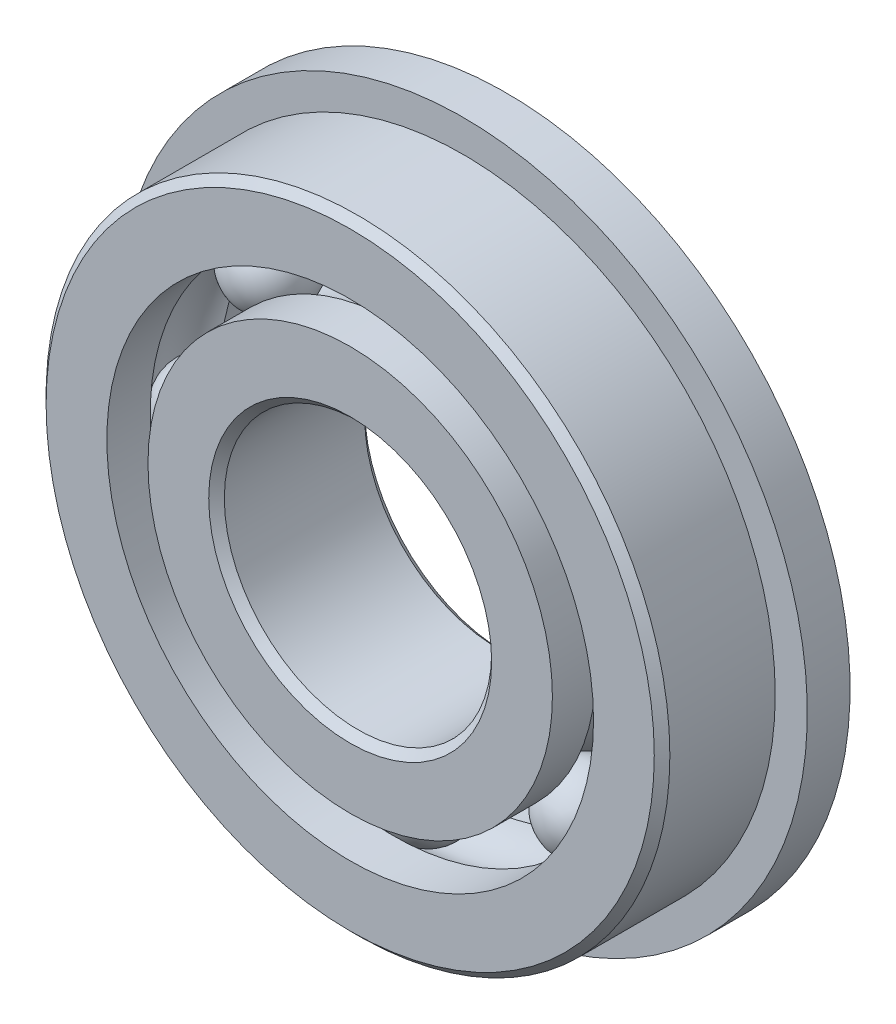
from build123d import *

# Parameters (mm, degrees)
CIRPATTERN1_COUNT = 8
SKETCH6_W         = 1.524
SKETCH6_H         = 3.585307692


with BuildPart() as part:
    # Sketch1 → Revolve1 (revolve)
    with BuildSketch(Plane(origin=(0, 0, 0), x_dir=(0, 0, -1), z_dir=(1, 0, 0)), mode=Mode.PRIVATE) as revolve1_sk:
        with BuildLine():
            Line((2.5003125, 11.1125), (-2.5003125, 11.1125))
            Line((-2.5003125, 11.1125), (-2.778125, 10.8346875))
            Line((-2.778125, 10.8346875), (-2.778125, 8.670192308))
            Line((-2.778125, 8.670192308), (-1.234722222, 8.670192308))
            ThreePointArc((-1.234722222, 8.670192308), (0, 9.373249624), (1.234722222, 8.670192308))
            Line((1.234722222, 8.670192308), (2.778125, 8.670192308))
            Line((2.778125, 8.670192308), (2.778125, 10.8346875))
            Line((2.778125, 10.8346875), (2.5003125, 11.1125))
        make_face()
    revolve(revolve1_sk.sketch.rotate(Axis((0, 0, 2.778125), (0, 0, -1)), 90), axis=Axis((0, 0, 2.778125), (0, 0, -1)))

    # Sketch6 → Revolve6 (revolve)
    with BuildSketch(Plane(origin=(0, 0, 0), x_dir=(0, 0, -1), z_dir=(1, 0, 0)), mode=Mode.PRIVATE) as revolve6_sk:
        with Locations((2.016125, 10.462846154)):
            Rectangle(SKETCH6_W, SKETCH6_H)
    revolve(revolve6_sk.sketch.rotate(Axis((0, 0, -2.778125), (0, 0, 1)), 270), axis=Axis((0, 0, -2.778125), (0, 0, 1)))


with BuildPart() as body_2:
    # Sketch3 → Revolve3 (revolve)
    with BuildSketch(Plane(origin=(0, 0, 0), x_dir=(0, 0, -1), z_dir=(1, 0, 0)), mode=Mode.PRIVATE) as revolve3_sk:
        with BuildLine():
            Line((-2.778125, 7.204807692), (-1.234722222, 7.204807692))
            ThreePointArc((-1.234722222, 7.204807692), (0, 6.501750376), (1.234722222, 7.204807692))
            Line((1.234722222, 7.204807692), (2.778125, 7.204807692))
            Line((2.778125, 7.204807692), (2.778125, 5.0403125))
            Line((2.778125, 5.0403125), (2.5003125, 4.7625))
            Line((2.5003125, 4.7625), (-2.5003125, 4.7625))
            Line((-2.5003125, 4.7625), (-2.778125, 5.0403125))
            Line((-2.778125, 5.0403125), (-2.778125, 7.204807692))
        make_face()
    revolve(revolve3_sk.sketch.rotate(Axis((0, 0, 2.778125), (0, 0, -1)), 90), axis=Axis((0, 0, 2.778125), (0, 0, -1)))


with BuildPart() as body_3:
    # Sketch4 → Revolve4 (revolve)
    with BuildSketch(Plane(origin=(0, 0, 0), x_dir=(0, 0, -1), z_dir=(1, 0, 0))):
        with BuildLine():
            Line((-1.435749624, 7.9375), (1.435749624, 7.9375))
            ThreePointArc((1.435749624, 7.9375), (0, 9.373249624), (-1.435749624, 7.9375))
        make_face()
    revolve(axis=Axis((0, 7.9375, 1.435749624), (0, 0, -1)))


with BuildPart() as cirpattern1_1:
    # CirPattern1: pattern copy
    add(body_3.part.rotate(Axis((0, 0, 0), (0, 0, 1)), 1 * 360 / CIRPATTERN1_COUNT))


with BuildPart() as cirpattern1_2:
    # CirPattern1: pattern copy
    add(body_3.part.rotate(Axis((0, 0, 0), (0, 0, 1)), 2 * 360 / CIRPATTERN1_COUNT))


with BuildPart() as cirpattern1_3:
    # CirPattern1: pattern copy
    add(body_3.part.rotate(Axis((0, 0, 0), (0, 0, 1)), 3 * 360 / CIRPATTERN1_COUNT))


with BuildPart() as cirpattern1_4:
    # CirPattern1: pattern copy
    add(body_3.part.rotate(Axis((0, 0, 0), (0, 0, 1)), 4 * 360 / CIRPATTERN1_COUNT))


with BuildPart() as cirpattern1_5:
    # CirPattern1: pattern copy
    add(body_3.part.rotate(Axis((0, 0, 0), (0, 0, 1)), 5 * 360 / CIRPATTERN1_COUNT))


with BuildPart() as cirpattern1_6:
    # CirPattern1: pattern copy
    add(body_3.part.rotate(Axis((0, 0, 0), (0, 0, 1)), 6 * 360 / CIRPATTERN1_COUNT))


with BuildPart() as cirpattern1_7:
    # CirPattern1: pattern copy
    add(body_3.part.rotate(Axis((0, 0, 0), (0, 0, 1)), 7 * 360 / CIRPATTERN1_COUNT))


solid = Compound([part.part, body_2.part, body_3.part, cirpattern1_1.part, cirpattern1_2.part, cirpattern1_3.part, cirpattern1_4.part, cirpattern1_5.part, cirpattern1_6.part, cirpattern1_7.part])
